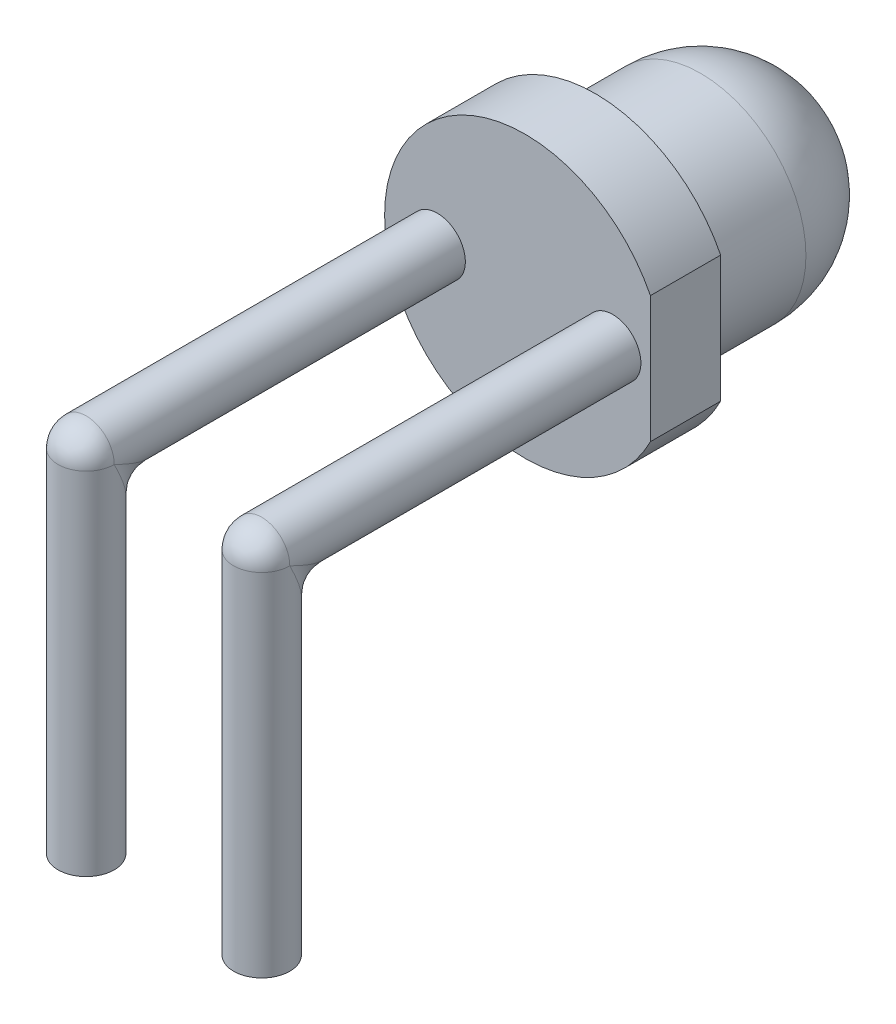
ISO-10303-21;
HEADER;
FILE_DESCRIPTION(('STEP AP214'),'2;1');
FILE_NAME('part.step','',(''),(''),'','','');
FILE_SCHEMA(('AUTOMOTIVE_DESIGN { 1 0 10303 214 1 1 1 1 }'));
ENDSEC;
DATA;
#1=APPLICATION_CONTEXT('core data for automotive mechanical design processes');
#2=APPLICATION_PROTOCOL_DEFINITION('international standard','automotive_design',2000,#1);
#3=PRODUCT_CONTEXT('',#1,'mechanical');
#4=PRODUCT('Part','Part','',(#3));
#5=PRODUCT_RELATED_PRODUCT_CATEGORY('part','',(#4));
#6=PRODUCT_DEFINITION_FORMATION('','',#4);
#7=PRODUCT_DEFINITION_CONTEXT('part definition',#1,'design');
#8=PRODUCT_DEFINITION('design','',#6,#7);
#9=PRODUCT_DEFINITION_SHAPE('','',#8);
#10=(LENGTH_UNIT() NAMED_UNIT(*) SI_UNIT(.MILLI.,.METRE.));
#11=(NAMED_UNIT(*) PLANE_ANGLE_UNIT() SI_UNIT($,.RADIAN.));
#12=(NAMED_UNIT(*) SI_UNIT($,.STERADIAN.) SOLID_ANGLE_UNIT());
#13=UNCERTAINTY_MEASURE_WITH_UNIT(LENGTH_MEASURE(1.E-05),#10,'distance_accuracy_value','');
#14=(GEOMETRIC_REPRESENTATION_CONTEXT(3) GLOBAL_UNCERTAINTY_ASSIGNED_CONTEXT((#13)) GLOBAL_UNIT_ASSIGNED_CONTEXT((#10,
#11,#12)) REPRESENTATION_CONTEXT('',''));
#15=CARTESIAN_POINT('',(0.,0.,0.));
#16=DIRECTION('',(0.,0.,1.));
#17=DIRECTION('',(1.,0.,0.));
#18=AXIS2_PLACEMENT_3D('',#15,#16,#17);
#19=CARTESIAN_POINT('',(0.,0.,4.));
#20=DIRECTION('',(0.,0.,-1.));
#21=DIRECTION('',(-1.,0.,0.));
#22=AXIS2_PLACEMENT_3D('',#19,#20,#21);
#23=CYLINDRICAL_SURFACE('',#22,1.5);
#24=CARTESIAN_POINT('',(0.,0.,1.5));
#25=DIRECTION('',(0.,0.,-1.));
#26=DIRECTION('',(-1.,0.,0.));
#27=AXIS2_PLACEMENT_3D('',#24,#25,#26);
#28=CIRCLE('',#27,1.5);
#29=CARTESIAN_POINT('',(-1.5,0.,1.5));
#30=VERTEX_POINT('',#29);
#31=EDGE_CURVE('E94',#30,#30,#28,.F.);
#32=ORIENTED_EDGE('',*,*,#31,.T.);
#33=EDGE_LOOP('',(#32));
#34=FACE_BOUND('',#33,.T.);
#35=CARTESIAN_POINT('',(0.,0.,3.));
#36=DIRECTION('',(0.,0.,1.));
#37=DIRECTION('',(1.,0.,0.));
#38=AXIS2_PLACEMENT_3D('',#35,#36,#37);
#39=CIRCLE('',#38,1.5);
#40=CARTESIAN_POINT('',(1.5,0.,3.));
#41=VERTEX_POINT('',#40);
#42=EDGE_CURVE('E90',#41,#41,#39,.T.);
#43=ORIENTED_EDGE('',*,*,#42,.F.);
#44=EDGE_LOOP('',(#43));
#45=FACE_BOUND('',#44,.T.);
#46=ADVANCED_FACE('F28',(#34,#45),#23,.T.);
#47=CARTESIAN_POINT('',(0.,0.,3.));
#48=DIRECTION('',(0.,0.,1.));
#49=DIRECTION('',(1.,0.,0.));
#50=AXIS2_PLACEMENT_3D('',#47,#48,#49);
#51=PLANE('',#50);
#52=CARTESIAN_POINT('',(0.,0.,3.));
#53=DIRECTION('',(0.,0.,1.));
#54=DIRECTION('',(1.,0.,0.));
#55=AXIS2_PLACEMENT_3D('',#52,#53,#54);
#56=CIRCLE('',#55,2.);
#57=CARTESIAN_POINT('',(1.78571428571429,0.900680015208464,3.));
#58=VERTEX_POINT('',#57);
#59=CARTESIAN_POINT('',(1.78571428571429,-0.900680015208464,3.));
#60=VERTEX_POINT('',#59);
#61=EDGE_CURVE('E71',#58,#60,#56,.T.);
#62=ORIENTED_EDGE('',*,*,#61,.F.);
#63=DIRECTION('',(0.,1.,0.));
#64=VECTOR('',#63,1.);
#65=CARTESIAN_POINT('',(1.78571428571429,0.900680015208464,3.));
#66=LINE('',#65,#64);
#67=EDGE_CURVE('E77',#60,#58,#66,.T.);
#68=ORIENTED_EDGE('',*,*,#67,.F.);
#69=EDGE_LOOP('',(#62,#68));
#70=FACE_BOUND('',#69,.T.);
#71=ORIENTED_EDGE('',*,*,#42,.T.);
#72=EDGE_LOOP('',(#71));
#73=FACE_BOUND('',#72,.T.);
#74=ADVANCED_FACE('F135',(#70,#73),#51,.F.);
#75=CARTESIAN_POINT('',(0.,0.,3.));
#76=DIRECTION('',(0.,0.,1.));
#77=DIRECTION('',(1.,0.,0.));
#78=AXIS2_PLACEMENT_3D('',#75,#76,#77);
#79=CYLINDRICAL_SURFACE('',#78,2.);
#80=CARTESIAN_POINT('',(0.,0.,4.));
#81=DIRECTION('',(0.,0.,1.));
#82=DIRECTION('',(1.,0.,0.));
#83=AXIS2_PLACEMENT_3D('',#80,#81,#82);
#84=CIRCLE('',#83,2.);
#85=CARTESIAN_POINT('',(1.78571428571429,0.900680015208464,4.));
#86=VERTEX_POINT('',#85);
#87=CARTESIAN_POINT('',(1.78571428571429,-0.900680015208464,4.));
#88=VERTEX_POINT('',#87);
#89=EDGE_CURVE('E68',#86,#88,#84,.T.);
#90=ORIENTED_EDGE('',*,*,#89,.F.);
#91=DIRECTION('',(0.,0.,1.));
#92=VECTOR('',#91,1.);
#93=CARTESIAN_POINT('',(1.78571428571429,0.900680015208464,3.));
#94=LINE('',#93,#92);
#95=EDGE_CURVE('E76',#58,#86,#94,.T.);
#96=ORIENTED_EDGE('',*,*,#95,.F.);
#97=ORIENTED_EDGE('',*,*,#61,.T.);
#98=DIRECTION('',(0.,0.,1.));
#99=VECTOR('',#98,1.);
#100=CARTESIAN_POINT('',(1.78571428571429,-0.900680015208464,3.));
#101=LINE('',#100,#99);
#102=EDGE_CURVE('E65',#60,#88,#101,.T.);
#103=ORIENTED_EDGE('',*,*,#102,.T.);
#104=EDGE_LOOP('',(#90,#96,#97,#103));
#105=FACE_BOUND('',#104,.T.);
#106=ADVANCED_FACE('F67',(#105),#79,.T.);
#107=CARTESIAN_POINT('',(1.78571428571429,0.900680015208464,3.));
#108=DIRECTION('',(1.,0.,0.));
#109=DIRECTION('',(0.,0.,-1.));
#110=AXIS2_PLACEMENT_3D('',#107,#108,#109);
#111=PLANE('',#110);
#112=DIRECTION('',(0.,1.,0.));
#113=VECTOR('',#112,1.);
#114=CARTESIAN_POINT('',(1.78571428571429,0.900680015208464,4.));
#115=LINE('',#114,#113);
#116=EDGE_CURVE('E81',#88,#86,#115,.T.);
#117=ORIENTED_EDGE('',*,*,#116,.F.);
#118=ORIENTED_EDGE('',*,*,#102,.F.);
#119=ORIENTED_EDGE('',*,*,#67,.T.);
#120=ORIENTED_EDGE('',*,*,#95,.T.);
#121=EDGE_LOOP('',(#117,#118,#119,#120));
#122=FACE_BOUND('',#121,.T.);
#123=ADVANCED_FACE('F84',(#122),#111,.T.);
#124=CARTESIAN_POINT('',(0.,0.,4.));
#125=DIRECTION('',(0.,0.,1.));
#126=DIRECTION('',(1.,0.,0.));
#127=AXIS2_PLACEMENT_3D('',#124,#125,#126);
#128=PLANE('',#127);
#129=CARTESIAN_POINT('',(1.25,0.,4.));
#130=DIRECTION('',(0.,0.,1.));
#131=DIRECTION('',(1.,0.,0.));
#132=AXIS2_PLACEMENT_3D('',#129,#130,#131);
#133=CIRCLE('',#132,0.4);
#134=CARTESIAN_POINT('',(1.65,0.,4.));
#135=VERTEX_POINT('',#134);
#136=EDGE_CURVE('E102',#135,#135,#133,.T.);
#137=ORIENTED_EDGE('',*,*,#136,.F.);
#138=EDGE_LOOP('',(#137));
#139=FACE_BOUND('',#138,.T.);
#140=CARTESIAN_POINT('',(-1.25,0.,4.));
#141=DIRECTION('',(0.,0.,1.));
#142=DIRECTION('',(1.,0.,0.));
#143=AXIS2_PLACEMENT_3D('',#140,#141,#142);
#144=CIRCLE('',#143,0.4);
#145=CARTESIAN_POINT('',(-0.85,0.,4.));
#146=VERTEX_POINT('',#145);
#147=EDGE_CURVE('E97',#146,#146,#144,.T.);
#148=ORIENTED_EDGE('',*,*,#147,.F.);
#149=EDGE_LOOP('',(#148));
#150=FACE_BOUND('',#149,.T.);
#151=ORIENTED_EDGE('',*,*,#89,.T.);
#152=ORIENTED_EDGE('',*,*,#116,.T.);
#153=EDGE_LOOP('',(#151,#152));
#154=FACE_BOUND('',#153,.T.);
#155=ADVANCED_FACE('F80',(#139,#150,#154),#128,.T.);
#156=CARTESIAN_POINT('',(0.,0.,1.5));
#157=DIRECTION('',(0.,0.,1.));
#158=DIRECTION('',(1.,0.,0.));
#159=AXIS2_PLACEMENT_3D('',#156,#157,#158);
#160=SPHERICAL_SURFACE('',#159,1.5);
#161=ORIENTED_EDGE('',*,*,#31,.F.);
#162=EDGE_LOOP('',(#161));
#163=FACE_BOUND('',#162,.T.);
#164=ADVANCED_FACE('F149',(#163),#160,.T.);
#165=CARTESIAN_POINT('',(-1.25,0.,9.));
#166=DIRECTION('',(0.,-1.,0.));
#167=DIRECTION('',(0.,0.,-1.));
#168=AXIS2_PLACEMENT_3D('',#165,#166,#167);
#169=CYLINDRICAL_SURFACE('',#168,0.4);
#170=CARTESIAN_POINT('',(-1.25,0.,9.));
#171=DIRECTION('',(0.,0.447213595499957,-0.894427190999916));
#172=DIRECTION('',(0.,-0.894427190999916,-0.447213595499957));
#173=AXIS2_PLACEMENT_3D('',#170,#171,#172);
#174=ELLIPSE('',#173,0.894427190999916,0.4);
#175=CARTESIAN_POINT('',(-1.65,0.,9.));
#176=VERTEX_POINT('',#175);
#177=CARTESIAN_POINT('',(-0.85,0.,9.));
#178=VERTEX_POINT('',#177);
#179=EDGE_CURVE('E111',#176,#178,#174,.F.);
#180=ORIENTED_EDGE('',*,*,#179,.T.);
#181=CARTESIAN_POINT('',(-1.25,0.,9.));
#182=DIRECTION('',(0.,-1.,0.));
#183=DIRECTION('',(0.,0.,-1.));
#184=AXIS2_PLACEMENT_3D('',#181,#182,#183);
#185=CIRCLE('',#184,0.4);
#186=EDGE_CURVE('E114',#178,#176,#185,.T.);
#187=ORIENTED_EDGE('',*,*,#186,.T.);
#188=EDGE_LOOP('',(#180,#187));
#189=FACE_BOUND('',#188,.T.);
#190=CARTESIAN_POINT('',(-1.25,-5.,9.));
#191=DIRECTION('',(0.,-1.,0.));
#192=DIRECTION('',(0.,0.,-1.));
#193=AXIS2_PLACEMENT_3D('',#190,#191,#192);
#194=CIRCLE('',#193,0.4);
#195=CARTESIAN_POINT('',(-1.25,-5.,8.6));
#196=VERTEX_POINT('',#195);
#197=EDGE_CURVE('E82',#196,#196,#194,.F.);
#198=ORIENTED_EDGE('',*,*,#197,.T.);
#199=EDGE_LOOP('',(#198));
#200=FACE_BOUND('',#199,.T.);
#201=ADVANCED_FACE('F119',(#189,#200),#169,.T.);
#202=CARTESIAN_POINT('',(-1.25,0.,10.1313708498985));
#203=DIRECTION('',(0.,0.,-1.));
#204=DIRECTION('',(0.,1.,0.));
#205=AXIS2_PLACEMENT_3D('',#202,#203,#204);
#206=CYLINDRICAL_SURFACE('',#205,0.4);
#207=ORIENTED_EDGE('',*,*,#147,.T.);
#208=EDGE_LOOP('',(#207));
#209=FACE_BOUND('',#208,.T.);
#210=CARTESIAN_POINT('',(-1.25,0.,9.));
#211=DIRECTION('',(0.,0.,-1.));
#212=DIRECTION('',(0.,1.,0.));
#213=AXIS2_PLACEMENT_3D('',#210,#211,#212);
#214=CIRCLE('',#213,0.4);
#215=EDGE_CURVE('E35',#176,#178,#214,.T.);
#216=ORIENTED_EDGE('',*,*,#215,.T.);
#217=CARTESIAN_POINT('',(-1.25,0.,9.));
#218=DIRECTION('',(0.,0.894427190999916,-0.447213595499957));
#219=DIRECTION('',(0.,-0.447213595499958,-0.894427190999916));
#220=AXIS2_PLACEMENT_3D('',#217,#218,#219);
#221=ELLIPSE('',#220,0.894427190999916,0.4);
#222=EDGE_CURVE('E12',#178,#176,#221,.T.);
#223=ORIENTED_EDGE('',*,*,#222,.T.);
#224=EDGE_LOOP('',(#216,#223));
#225=FACE_BOUND('',#224,.T.);
#226=ADVANCED_FACE('F117',(#209,#225),#206,.T.);
#227=CARTESIAN_POINT('',(-1.25,-5.,9.));
#228=DIRECTION('',(0.,-1.,0.));
#229=DIRECTION('',(0.,0.,-1.));
#230=AXIS2_PLACEMENT_3D('',#227,#228,#229);
#231=PLANE('',#230);
#232=ORIENTED_EDGE('',*,*,#197,.F.);
#233=EDGE_LOOP('',(#232));
#234=FACE_BOUND('',#233,.T.);
#235=ADVANCED_FACE('F192',(#234),#231,.T.);
#236=CARTESIAN_POINT('',(1.25,0.,9.));
#237=DIRECTION('',(0.,-1.,0.));
#238=DIRECTION('',(0.,0.,-1.));
#239=AXIS2_PLACEMENT_3D('',#236,#237,#238);
#240=CYLINDRICAL_SURFACE('',#239,0.4);
#241=CARTESIAN_POINT('',(1.25,0.,9.));
#242=DIRECTION('',(0.,0.447213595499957,-0.894427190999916));
#243=DIRECTION('',(0.,-0.894427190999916,-0.447213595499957));
#244=AXIS2_PLACEMENT_3D('',#241,#242,#243);
#245=ELLIPSE('',#244,0.894427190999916,0.4);
#246=CARTESIAN_POINT('',(0.85,0.,9.));
#247=VERTEX_POINT('',#246);
#248=CARTESIAN_POINT('',(1.65,0.,9.));
#249=VERTEX_POINT('',#248);
#250=EDGE_CURVE('E98',#247,#249,#245,.F.);
#251=ORIENTED_EDGE('',*,*,#250,.T.);
#252=CARTESIAN_POINT('',(1.25,0.,9.));
#253=DIRECTION('',(0.,-1.,0.));
#254=DIRECTION('',(0.,0.,-1.));
#255=AXIS2_PLACEMENT_3D('',#252,#253,#254);
#256=CIRCLE('',#255,0.4);
#257=EDGE_CURVE('E101',#249,#247,#256,.T.);
#258=ORIENTED_EDGE('',*,*,#257,.T.);
#259=EDGE_LOOP('',(#251,#258));
#260=FACE_BOUND('',#259,.T.);
#261=CARTESIAN_POINT('',(1.25,-5.,9.));
#262=DIRECTION('',(0.,-1.,0.));
#263=DIRECTION('',(0.,0.,-1.));
#264=AXIS2_PLACEMENT_3D('',#261,#262,#263);
#265=CIRCLE('',#264,0.4);
#266=CARTESIAN_POINT('',(1.25,-5.,8.6));
#267=VERTEX_POINT('',#266);
#268=EDGE_CURVE('E255',#267,#267,#265,.F.);
#269=ORIENTED_EDGE('',*,*,#268,.T.);
#270=EDGE_LOOP('',(#269));
#271=FACE_BOUND('',#270,.T.);
#272=ADVANCED_FACE('F199',(#260,#271),#240,.T.);
#273=CARTESIAN_POINT('',(1.25,0.,10.1313708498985));
#274=DIRECTION('',(0.,0.,-1.));
#275=DIRECTION('',(0.,1.,0.));
#276=AXIS2_PLACEMENT_3D('',#273,#274,#275);
#277=CYLINDRICAL_SURFACE('',#276,0.4);
#278=ORIENTED_EDGE('',*,*,#136,.T.);
#279=EDGE_LOOP('',(#278));
#280=FACE_BOUND('',#279,.T.);
#281=CARTESIAN_POINT('',(1.25,0.,9.));
#282=DIRECTION('',(0.,0.,-1.));
#283=DIRECTION('',(0.,1.,0.));
#284=AXIS2_PLACEMENT_3D('',#281,#282,#283);
#285=CIRCLE('',#284,0.4);
#286=EDGE_CURVE('E105',#247,#249,#285,.T.);
#287=ORIENTED_EDGE('',*,*,#286,.T.);
#288=CARTESIAN_POINT('',(1.25,0.,9.));
#289=DIRECTION('',(0.,0.894427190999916,-0.447213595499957));
#290=DIRECTION('',(0.,-0.447213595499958,-0.894427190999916));
#291=AXIS2_PLACEMENT_3D('',#288,#289,#290);
#292=ELLIPSE('',#291,0.894427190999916,0.4);
#293=EDGE_CURVE('E108',#249,#247,#292,.T.);
#294=ORIENTED_EDGE('',*,*,#293,.T.);
#295=EDGE_LOOP('',(#287,#294));
#296=FACE_BOUND('',#295,.T.);
#297=ADVANCED_FACE('F206',(#280,#296),#277,.T.);
#298=CARTESIAN_POINT('',(1.25,-5.,9.));
#299=DIRECTION('',(0.,-1.,0.));
#300=DIRECTION('',(0.,0.,-1.));
#301=AXIS2_PLACEMENT_3D('',#298,#299,#300);
#302=PLANE('',#301);
#303=ORIENTED_EDGE('',*,*,#268,.F.);
#304=EDGE_LOOP('',(#303));
#305=FACE_BOUND('',#304,.T.);
#306=ADVANCED_FACE('F214',(#305),#302,.T.);
#307=CARTESIAN_POINT('',(1.25,0.,9.));
#308=DIRECTION('',(0.,0.,1.));
#309=DIRECTION('',(1.,0.,0.));
#310=AXIS2_PLACEMENT_3D('',#307,#308,#309);
#311=SPHERICAL_SURFACE('',#310,0.4);
#312=ORIENTED_EDGE('',*,*,#257,.F.);
#313=ORIENTED_EDGE('',*,*,#286,.F.);
#314=EDGE_LOOP('',(#312,#313));
#315=FACE_BOUND('',#314,.T.);
#316=ADVANCED_FACE('F131',(#315),#311,.T.);
#317=CARTESIAN_POINT('',(0.85,0.,9.));
#318=CARTESIAN_POINT('',(0.850000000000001,0.,9.));
#319=CARTESIAN_POINT('',(0.85,0.,9.));
#320=CARTESIAN_POINT('',(0.850007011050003,-0.034851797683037,8.98257410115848));
#321=CARTESIAN_POINT('',(0.849948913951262,-0.026144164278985,8.97385583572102));
#322=CARTESIAN_POINT('',(0.850007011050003,-0.0174258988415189,8.96514820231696));
#323=CARTESIAN_POINT('',(0.851139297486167,-0.0697124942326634,8.96514375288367));
#324=CARTESIAN_POINT('',(0.852279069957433,-0.0523600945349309,8.94763990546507));
#325=CARTESIAN_POINT('',(0.851139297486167,-0.0348562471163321,8.93028750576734));
#326=CARTESIAN_POINT('',(0.85568541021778,-0.138834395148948,8.93058280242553));
#327=CARTESIAN_POINT('',(0.861366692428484,-0.103749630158,8.896250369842));
#328=CARTESIAN_POINT('',(0.85568541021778,-0.0694171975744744,8.86116560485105));
#329=CARTESIAN_POINT('',(0.859079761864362,-0.173098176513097,8.91345091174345));
#330=CARTESIAN_POINT('',(0.868137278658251,-0.129071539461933,8.87092846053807));
#331=CARTESIAN_POINT('',(0.859079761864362,-0.0865490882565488,8.8269018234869));
#332=CARTESIAN_POINT('',(0.868103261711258,-0.240442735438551,8.87977863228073));
#333=CARTESIAN_POINT('',(0.885850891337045,-0.177786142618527,8.82221385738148));
#334=CARTESIAN_POINT('',(0.868103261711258,-0.120221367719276,8.75955726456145));
#335=CARTESIAN_POINT('',(0.873693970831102,-0.273533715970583,8.86323314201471));
#336=CARTESIAN_POINT('',(0.896819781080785,-0.201325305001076,8.79867469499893));
#337=CARTESIAN_POINT('',(0.873693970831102,-0.136766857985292,8.72646628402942));
#338=CARTESIAN_POINT('',(0.887036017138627,-0.337956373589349,8.83102181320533));
#339=CARTESIAN_POINT('',(0.922365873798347,-0.24561650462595,8.75438349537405));
#340=CARTESIAN_POINT('',(0.887036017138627,-0.168978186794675,8.66204362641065));
#341=CARTESIAN_POINT('',(0.894730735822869,-0.369311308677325,8.81534434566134));
#342=CARTESIAN_POINT('',(0.936981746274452,-0.266510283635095,8.73348971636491));
#343=CARTESIAN_POINT('',(0.89473073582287,-0.184655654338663,8.63068869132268));
#344=CARTESIAN_POINT('',(0.912166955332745,-0.429711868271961,8.78514406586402));
#345=CARTESIAN_POINT('',(0.968999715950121,-0.304712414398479,8.69528758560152));
#346=CARTESIAN_POINT('',(0.912166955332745,-0.214855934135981,8.57028813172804));
#347=CARTESIAN_POINT('',(0.921835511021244,-0.458799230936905,8.77060038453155));
#348=CARTESIAN_POINT('',(0.986451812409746,-0.322154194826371,8.67784580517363));
#349=CARTESIAN_POINT('',(0.921835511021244,-0.229399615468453,8.5412007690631));
#350=CARTESIAN_POINT('',(0.943070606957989,-0.514147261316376,8.74292636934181));
#351=CARTESIAN_POINT('',(1.02298136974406,-0.352779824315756,8.64722017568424));
#352=CARTESIAN_POINT('',(0.943070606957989,-0.257073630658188,8.48585273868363));
#353=CARTESIAN_POINT('',(0.954551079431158,-0.540473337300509,8.72976333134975));
#354=CARTESIAN_POINT('',(1.04211684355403,-0.366083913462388,8.63391608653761));
#355=CARTESIAN_POINT('',(0.954551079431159,-0.270236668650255,8.45952666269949));
#356=CARTESIAN_POINT('',(0.979226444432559,-0.589823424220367,8.70508828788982));
#357=CARTESIAN_POINT('',(1.08048212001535,-0.388004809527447,8.61199519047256));
#358=CARTESIAN_POINT('',(0.979226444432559,-0.294911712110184,8.41017657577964));
#359=CARTESIAN_POINT('',(0.992327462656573,-0.612940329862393,8.6935298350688));
#360=CARTESIAN_POINT('',(1.09977183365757,-0.396723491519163,8.60327650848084));
#361=CARTESIAN_POINT('',(0.992327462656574,-0.306470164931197,8.38705967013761));
#362=CARTESIAN_POINT('',(1.02002657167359,-0.655447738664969,8.67227613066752));
#363=CARTESIAN_POINT('',(1.13658531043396,-0.409472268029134,8.59052773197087));
#364=CARTESIAN_POINT('',(1.02002657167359,-0.327723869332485,8.34455226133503));
#365=CARTESIAN_POINT('',(1.03453090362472,-0.67495903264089,8.66252048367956));
#366=CARTESIAN_POINT('',(1.15416238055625,-0.413582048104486,8.58641795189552));
#367=CARTESIAN_POINT('',(1.03453090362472,-0.337479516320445,8.32504096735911));
#368=CARTESIAN_POINT('',(1.06478591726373,-0.709892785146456,8.64505360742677));
#369=CARTESIAN_POINT('',(1.18560301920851,-0.417771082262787,8.58222891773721));
#370=CARTESIAN_POINT('',(1.06478591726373,-0.354946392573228,8.29010721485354));
#371=CARTESIAN_POINT('',(1.08045326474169,-0.725457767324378,8.63727111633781));
#372=CARTESIAN_POINT('',(1.19950490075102,-0.417907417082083,8.58209258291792));
#373=CARTESIAN_POINT('',(1.08045326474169,-0.362728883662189,8.27454223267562));
#374=CARTESIAN_POINT('',(1.11275138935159,-0.752212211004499,8.62389389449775));
#375=CARTESIAN_POINT('',(1.2221313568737,-0.415624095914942,8.58437590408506));
#376=CARTESIAN_POINT('',(1.11275138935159,-0.37610610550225,8.2477877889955));
#377=CARTESIAN_POINT('',(1.12931994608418,-0.763549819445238,8.61822509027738));
#378=CARTESIAN_POINT('',(1.23087565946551,-0.413242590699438,8.58675740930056));
#379=CARTESIAN_POINT('',(1.12931994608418,-0.381774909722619,8.23645018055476));
#380=CARTESIAN_POINT('',(1.16310979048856,-0.781655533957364,8.60917223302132));
#381=CARTESIAN_POINT('',(1.2430647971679,-0.408038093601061,8.59196190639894));
#382=CARTESIAN_POINT('',(1.16310979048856,-0.390827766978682,8.21834446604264));
#383=CARTESIAN_POINT('',(1.18029654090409,-0.78855062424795,8.60572468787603));
#384=CARTESIAN_POINT('',(1.24651525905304,-0.405239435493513,8.59476056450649));
#385=CARTESIAN_POINT('',(1.18029654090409,-0.394275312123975,8.21144937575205));
#386=CARTESIAN_POINT('',(1.21499550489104,-0.79768559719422,8.60115720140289));
#387=CARTESIAN_POINT('',(1.24997691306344,-0.401214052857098,8.5987859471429));
#388=CARTESIAN_POINT('',(1.21499550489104,-0.39884279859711,8.20231440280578));
#389=CARTESIAN_POINT('',(1.23249775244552,-0.800000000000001,8.6));
#390=CARTESIAN_POINT('',(1.24998842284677,-0.400000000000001,8.6));
#391=CARTESIAN_POINT('',(1.23249775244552,-0.400000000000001,8.2));
#392=CARTESIAN_POINT('',(1.26750224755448,-0.800000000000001,8.6));
#393=CARTESIAN_POINT('',(1.25001157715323,-0.400000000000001,8.6));
#394=CARTESIAN_POINT('',(1.26750224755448,-0.400000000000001,8.2));
#395=CARTESIAN_POINT('',(1.28500449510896,-0.79768559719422,8.60115720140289));
#396=CARTESIAN_POINT('',(1.25002308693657,-0.401214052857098,8.5987859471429));
#397=CARTESIAN_POINT('',(1.28500449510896,-0.39884279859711,8.20231440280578));
#398=CARTESIAN_POINT('',(1.31970345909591,-0.78855062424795,8.60572468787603));
#399=CARTESIAN_POINT('',(1.25348474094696,-0.405239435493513,8.59476056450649));
#400=CARTESIAN_POINT('',(1.31970345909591,-0.394275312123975,8.21144937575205));
#401=CARTESIAN_POINT('',(1.33689020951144,-0.781655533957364,8.60917223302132));
#402=CARTESIAN_POINT('',(1.2569352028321,-0.408038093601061,8.59196190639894));
#403=CARTESIAN_POINT('',(1.33689020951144,-0.390827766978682,8.21834446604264));
#404=CARTESIAN_POINT('',(1.37068005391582,-0.763549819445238,8.61822509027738));
#405=CARTESIAN_POINT('',(1.26912434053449,-0.413242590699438,8.58675740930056));
#406=CARTESIAN_POINT('',(1.37068005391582,-0.381774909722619,8.23645018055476));
#407=CARTESIAN_POINT('',(1.38724861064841,-0.752212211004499,8.62389389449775));
#408=CARTESIAN_POINT('',(1.2778686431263,-0.415624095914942,8.58437590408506));
#409=CARTESIAN_POINT('',(1.38724861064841,-0.37610610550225,8.2477877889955));
#410=CARTESIAN_POINT('',(1.41954673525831,-0.725457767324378,8.63727111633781));
#411=CARTESIAN_POINT('',(1.30049509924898,-0.417907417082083,8.58209258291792));
#412=CARTESIAN_POINT('',(1.41954673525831,-0.362728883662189,8.27454223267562));
#413=CARTESIAN_POINT('',(1.43521408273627,-0.709892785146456,8.64505360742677));
#414=CARTESIAN_POINT('',(1.31439698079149,-0.417771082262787,8.58222891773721));
#415=CARTESIAN_POINT('',(1.43521408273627,-0.354946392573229,8.29010721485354));
#416=CARTESIAN_POINT('',(1.46546909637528,-0.674959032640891,8.66252048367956));
#417=CARTESIAN_POINT('',(1.34583761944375,-0.413582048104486,8.58641795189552));
#418=CARTESIAN_POINT('',(1.46546909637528,-0.337479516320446,8.32504096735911));
#419=CARTESIAN_POINT('',(1.47997342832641,-0.655447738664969,8.67227613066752));
#420=CARTESIAN_POINT('',(1.36341468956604,-0.409472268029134,8.59052773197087));
#421=CARTESIAN_POINT('',(1.47997342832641,-0.327723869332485,8.34455226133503));
#422=CARTESIAN_POINT('',(1.50767253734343,-0.612940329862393,8.69352983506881));
#423=CARTESIAN_POINT('',(1.40022816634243,-0.396723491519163,8.60327650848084));
#424=CARTESIAN_POINT('',(1.50767253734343,-0.306470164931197,8.38705967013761));
#425=CARTESIAN_POINT('',(1.52077355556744,-0.589823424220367,8.70508828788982));
#426=CARTESIAN_POINT('',(1.41951787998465,-0.388004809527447,8.61199519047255));
#427=CARTESIAN_POINT('',(1.52077355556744,-0.294911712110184,8.41017657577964));
#428=CARTESIAN_POINT('',(1.54544892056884,-0.540473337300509,8.72976333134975));
#429=CARTESIAN_POINT('',(1.45788315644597,-0.366083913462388,8.63391608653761));
#430=CARTESIAN_POINT('',(1.54544892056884,-0.270236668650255,8.45952666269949));
#431=CARTESIAN_POINT('',(1.55692939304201,-0.514147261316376,8.74292636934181));
#432=CARTESIAN_POINT('',(1.47701863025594,-0.352779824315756,8.64722017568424));
#433=CARTESIAN_POINT('',(1.55692939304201,-0.257073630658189,8.48585273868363));
#434=CARTESIAN_POINT('',(1.57816448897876,-0.458799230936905,8.77060038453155));
#435=CARTESIAN_POINT('',(1.51354818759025,-0.322154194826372,8.67784580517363));
#436=CARTESIAN_POINT('',(1.57816448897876,-0.229399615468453,8.5412007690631));
#437=CARTESIAN_POINT('',(1.58783304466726,-0.429711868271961,8.78514406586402));
#438=CARTESIAN_POINT('',(1.53100028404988,-0.304712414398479,8.69528758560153));
#439=CARTESIAN_POINT('',(1.58783304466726,-0.214855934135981,8.57028813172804));
#440=CARTESIAN_POINT('',(1.60526926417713,-0.369311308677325,8.81534434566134));
#441=CARTESIAN_POINT('',(1.56301825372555,-0.266510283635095,8.73348971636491));
#442=CARTESIAN_POINT('',(1.60526926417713,-0.184655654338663,8.63068869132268));
#443=CARTESIAN_POINT('',(1.61296398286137,-0.337956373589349,8.83102181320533));
#444=CARTESIAN_POINT('',(1.57763412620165,-0.24561650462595,8.75438349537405));
#445=CARTESIAN_POINT('',(1.61296398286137,-0.168978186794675,8.66204362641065));
#446=CARTESIAN_POINT('',(1.6263060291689,-0.273533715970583,8.86323314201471));
#447=CARTESIAN_POINT('',(1.60318021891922,-0.201325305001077,8.79867469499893));
#448=CARTESIAN_POINT('',(1.6263060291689,-0.136766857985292,8.72646628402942));
#449=CARTESIAN_POINT('',(1.63189673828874,-0.240442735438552,8.87977863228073));
#450=CARTESIAN_POINT('',(1.61414910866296,-0.177786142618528,8.82221385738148));
#451=CARTESIAN_POINT('',(1.63189673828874,-0.120221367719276,8.75955726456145));
#452=CARTESIAN_POINT('',(1.64092023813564,-0.173098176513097,8.91345091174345));
#453=CARTESIAN_POINT('',(1.63186272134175,-0.129071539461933,8.87092846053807));
#454=CARTESIAN_POINT('',(1.64092023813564,-0.0865490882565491,8.8269018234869));
#455=CARTESIAN_POINT('',(1.64431458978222,-0.138834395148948,8.93058280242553));
#456=CARTESIAN_POINT('',(1.63863330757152,-0.103749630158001,8.896250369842));
#457=CARTESIAN_POINT('',(1.64431458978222,-0.0694171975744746,8.86116560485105));
#458=CARTESIAN_POINT('',(1.64886070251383,-0.0697124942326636,8.96514375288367));
#459=CARTESIAN_POINT('',(1.64772093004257,-0.0523600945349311,8.94763990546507));
#460=CARTESIAN_POINT('',(1.64886070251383,-0.0348562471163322,8.93028750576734));
#461=CARTESIAN_POINT('',(1.64999298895,-0.034851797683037,8.98257410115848));
#462=CARTESIAN_POINT('',(1.65005108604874,-0.0261441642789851,8.97385583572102));
#463=CARTESIAN_POINT('',(1.64999298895,-0.017425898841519,8.96514820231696));
#464=CARTESIAN_POINT('',(1.65,0.,9.));
#465=CARTESIAN_POINT('',(1.65,0.,9.));
#466=CARTESIAN_POINT('',(1.65,0.,9.));
#467=(BOUNDED_SURFACE() B_SPLINE_SURFACE(3,2,((#317,#318,#319),(#320,#321,#322),(#323,#324,
#325),(#326,#327,#328),(#329,#330,#331),(#332,#333,#334),(#335,#336,#337),(#338,#339,#340),
(#341,#342,#343),(#344,#345,#346),(#347,#348,#349),(#350,#351,#352),(#353,#354,#355),(#356,#357,
#358),(#359,#360,#361),(#362,#363,#364),(#365,#366,#367),(#368,#369,#370),(#371,#372,#373),
(#374,#375,#376),(#377,#378,#379),(#380,#381,#382),(#383,#384,#385),(#386,#387,#388),(#389,#390,
#391),(#392,#393,#394),(#395,#396,#397),(#398,#399,#400),(#401,#402,#403),(#404,#405,#406),
(#407,#408,#409),(#410,#411,#412),(#413,#414,#415),(#416,#417,#418),(#419,#420,#421),(#422,#423,
#424),(#425,#426,#427),(#428,#429,#430),(#431,#432,#433),(#434,#435,#436),(#437,#438,#439),
(#440,#441,#442),(#443,#444,#445),(#446,#447,#448),(#449,#450,#451),(#452,#453,#454),(#455,#456,
#457),(#458,#459,#460),(#461,#462,#463),(#464,#465,#466)),.UNSPECIFIED.,.F.,.F.,
.F.) B_SPLINE_SURFACE_WITH_KNOTS((4,2,2,2,2,2,2,2,2,2,2,2,2,2,2,2,2,2,2,2,2,2,2,2,4),(3,3),(0.,
0.147832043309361,0.294407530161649,0.438524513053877,0.579091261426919,0.715183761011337,
0.84610562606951,0.971449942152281,1.09116027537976,1.2055837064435,1.31550198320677,
1.42211980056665,1.52698838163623,1.63185696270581,1.73847478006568,1.84839305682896,
1.9628164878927,2.08252682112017,2.20787113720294,2.33879300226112,2.47488550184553,
2.61545225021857,2.7595692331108,2.90614471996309,3.05397676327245),(0.,1.),
.UNSPECIFIED.) GEOMETRIC_REPRESENTATION_ITEM() RATIONAL_B_SPLINE_SURFACE(((1.,1.,1.),(1.,
1.00000566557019,1.),(1.,0.998576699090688,1.),(1.,0.992910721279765,1.),(1.,0.988697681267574,
1.),(1.,0.97761712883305,1.),(1.,0.970795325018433,1.),(1.,0.954789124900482,1.),(1.,
0.945667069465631,1.),(1.,0.92548796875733,1.),(1.,0.914501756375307,1.),(1.,0.891169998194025,
1.),(1.,0.878891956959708,1.),(1.,0.853706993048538,1.),(1.,0.840849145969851,1.),(1.,
0.815387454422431,1.),(1.,0.802798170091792,1.),(1.,0.778880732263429,1.),(1.,0.767521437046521,
1.),(1.,0.747118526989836,1.),(1.,0.738001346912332,1.),(1.,0.723039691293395,1.),(1.,
0.717105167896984,1.),(1.,0.709170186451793,1.),(1.,0.707106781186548,1.),(1.,0.707106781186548,
1.),(1.,0.709170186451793,1.),(1.,0.717105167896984,1.),(1.,0.723039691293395,1.),(1.,
0.738001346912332,1.),(1.,0.747118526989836,1.),(1.,0.767521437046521,1.),(1.,0.778880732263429,
1.),(1.,0.802798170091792,1.),(1.,0.815387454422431,1.),(1.,0.84084914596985,1.),(1.,
0.853706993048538,1.),(1.,0.878891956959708,1.),(1.,0.891169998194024,1.),(1.,0.914501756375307,
1.),(1.,0.92548796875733,1.),(1.,0.945667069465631,1.),(1.,0.954789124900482,1.),(1.,
0.970795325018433,1.),(1.,0.977617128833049,1.),(1.,0.988697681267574,1.),(1.,0.992910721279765,
1.),(1.,0.998576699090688,1.),(1.,1.00000566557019,1.),(1.,1.,1.))) REPRESENTATION_ITEM('') SURFACE());
#468=ORIENTED_EDGE('',*,*,#250,.F.);
#469=ORIENTED_EDGE('',*,*,#293,.F.);
#470=EDGE_LOOP('',(#468,#469));
#471=FACE_BOUND('',#470,.T.);
#472=ADVANCED_FACE('F124',(#471),#467,.F.);
#473=CARTESIAN_POINT('',(-1.25,0.,9.));
#474=DIRECTION('',(0.,0.,1.));
#475=DIRECTION('',(1.,0.,0.));
#476=AXIS2_PLACEMENT_3D('',#473,#474,#475);
#477=SPHERICAL_SURFACE('',#476,0.4);
#478=ORIENTED_EDGE('',*,*,#186,.F.);
#479=ORIENTED_EDGE('',*,*,#215,.F.);
#480=EDGE_LOOP('',(#478,#479));
#481=FACE_BOUND('',#480,.T.);
#482=ADVANCED_FACE('F121',(#481),#477,.T.);
#483=CARTESIAN_POINT('',(-1.65,0.,9.));
#484=CARTESIAN_POINT('',(-1.65,0.,9.));
#485=CARTESIAN_POINT('',(-1.65,0.,9.));
#486=CARTESIAN_POINT('',(-1.64999298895,-0.0348517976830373,8.98257410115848));
#487=CARTESIAN_POINT('',(-1.65005108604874,-0.0261441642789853,8.97385583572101));
#488=CARTESIAN_POINT('',(-1.64999298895,-0.0174258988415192,8.96514820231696));
#489=CARTESIAN_POINT('',(-1.64886070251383,-0.0697124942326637,8.96514375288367));
#490=CARTESIAN_POINT('',(-1.64772093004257,-0.0523600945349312,8.94763990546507));
#491=CARTESIAN_POINT('',(-1.64886070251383,-0.0348562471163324,8.93028750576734));
#492=CARTESIAN_POINT('',(-1.64431458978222,-0.138834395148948,8.93058280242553));
#493=CARTESIAN_POINT('',(-1.63863330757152,-0.103749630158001,8.896250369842));
#494=CARTESIAN_POINT('',(-1.64431458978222,-0.0694171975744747,8.86116560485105));
#495=CARTESIAN_POINT('',(-1.64092023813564,-0.173098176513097,8.91345091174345));
#496=CARTESIAN_POINT('',(-1.63186272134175,-0.129071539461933,8.87092846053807));
#497=CARTESIAN_POINT('',(-1.64092023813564,-0.0865490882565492,8.8269018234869));
#498=CARTESIAN_POINT('',(-1.63189673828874,-0.240442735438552,8.87977863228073));
#499=CARTESIAN_POINT('',(-1.61414910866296,-0.177786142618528,8.82221385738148));
#500=CARTESIAN_POINT('',(-1.63189673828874,-0.120221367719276,8.75955726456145));
#501=CARTESIAN_POINT('',(-1.6263060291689,-0.273533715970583,8.86323314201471));
#502=CARTESIAN_POINT('',(-1.60318021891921,-0.201325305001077,8.79867469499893));
#503=CARTESIAN_POINT('',(-1.6263060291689,-0.136766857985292,8.72646628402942));
#504=CARTESIAN_POINT('',(-1.61296398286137,-0.337956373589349,8.83102181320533));
#505=CARTESIAN_POINT('',(-1.57763412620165,-0.24561650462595,8.75438349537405));
#506=CARTESIAN_POINT('',(-1.61296398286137,-0.168978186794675,8.66204362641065));
#507=CARTESIAN_POINT('',(-1.60526926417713,-0.369311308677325,8.81534434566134));
#508=CARTESIAN_POINT('',(-1.56301825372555,-0.266510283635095,8.73348971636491));
#509=CARTESIAN_POINT('',(-1.60526926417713,-0.184655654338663,8.63068869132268));
#510=CARTESIAN_POINT('',(-1.58783304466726,-0.429711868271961,8.78514406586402));
#511=CARTESIAN_POINT('',(-1.53100028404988,-0.304712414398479,8.69528758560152));
#512=CARTESIAN_POINT('',(-1.58783304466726,-0.214855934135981,8.57028813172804));
#513=CARTESIAN_POINT('',(-1.57816448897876,-0.458799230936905,8.77060038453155));
#514=CARTESIAN_POINT('',(-1.51354818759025,-0.322154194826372,8.67784580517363));
#515=CARTESIAN_POINT('',(-1.57816448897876,-0.229399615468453,8.5412007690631));
#516=CARTESIAN_POINT('',(-1.55692939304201,-0.514147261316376,8.74292636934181));
#517=CARTESIAN_POINT('',(-1.47701863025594,-0.352779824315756,8.64722017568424));
#518=CARTESIAN_POINT('',(-1.55692939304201,-0.257073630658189,8.48585273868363));
#519=CARTESIAN_POINT('',(-1.54544892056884,-0.540473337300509,8.72976333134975));
#520=CARTESIAN_POINT('',(-1.45788315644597,-0.366083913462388,8.63391608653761));
#521=CARTESIAN_POINT('',(-1.54544892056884,-0.270236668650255,8.45952666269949));
#522=CARTESIAN_POINT('',(-1.52077355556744,-0.589823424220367,8.70508828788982));
#523=CARTESIAN_POINT('',(-1.41951787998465,-0.388004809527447,8.61199519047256));
#524=CARTESIAN_POINT('',(-1.52077355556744,-0.294911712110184,8.41017657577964));
#525=CARTESIAN_POINT('',(-1.50767253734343,-0.612940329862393,8.6935298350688));
#526=CARTESIAN_POINT('',(-1.40022816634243,-0.396723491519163,8.60327650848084));
#527=CARTESIAN_POINT('',(-1.50767253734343,-0.306470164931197,8.38705967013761));
#528=CARTESIAN_POINT('',(-1.47997342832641,-0.655447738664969,8.67227613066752));
#529=CARTESIAN_POINT('',(-1.36341468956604,-0.409472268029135,8.59052773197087));
#530=CARTESIAN_POINT('',(-1.47997342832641,-0.327723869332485,8.34455226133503));
#531=CARTESIAN_POINT('',(-1.46546909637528,-0.67495903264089,8.66252048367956));
#532=CARTESIAN_POINT('',(-1.34583761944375,-0.413582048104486,8.58641795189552));
#533=CARTESIAN_POINT('',(-1.46546909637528,-0.337479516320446,8.32504096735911));
#534=CARTESIAN_POINT('',(-1.43521408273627,-0.709892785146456,8.64505360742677));
#535=CARTESIAN_POINT('',(-1.31439698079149,-0.417771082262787,8.58222891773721));
#536=CARTESIAN_POINT('',(-1.43521408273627,-0.354946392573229,8.29010721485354));
#537=CARTESIAN_POINT('',(-1.41954673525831,-0.725457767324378,8.63727111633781));
#538=CARTESIAN_POINT('',(-1.30049509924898,-0.417907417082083,8.58209258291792));
#539=CARTESIAN_POINT('',(-1.41954673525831,-0.36272888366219,8.27454223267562));
#540=CARTESIAN_POINT('',(-1.38724861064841,-0.7522122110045,8.62389389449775));
#541=CARTESIAN_POINT('',(-1.2778686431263,-0.415624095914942,8.58437590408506));
#542=CARTESIAN_POINT('',(-1.38724861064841,-0.37610610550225,8.2477877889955));
#543=CARTESIAN_POINT('',(-1.37068005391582,-0.763549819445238,8.61822509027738));
#544=CARTESIAN_POINT('',(-1.26912434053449,-0.413242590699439,8.58675740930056));
#545=CARTESIAN_POINT('',(-1.37068005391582,-0.38177490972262,8.23645018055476));
#546=CARTESIAN_POINT('',(-1.33689020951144,-0.781655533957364,8.60917223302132));
#547=CARTESIAN_POINT('',(-1.2569352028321,-0.408038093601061,8.59196190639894));
#548=CARTESIAN_POINT('',(-1.33689020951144,-0.390827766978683,8.21834446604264));
#549=CARTESIAN_POINT('',(-1.31970345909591,-0.78855062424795,8.60572468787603));
#550=CARTESIAN_POINT('',(-1.25348474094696,-0.405239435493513,8.59476056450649));
#551=CARTESIAN_POINT('',(-1.31970345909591,-0.394275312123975,8.21144937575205));
#552=CARTESIAN_POINT('',(-1.28500449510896,-0.79768559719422,8.60115720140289));
#553=CARTESIAN_POINT('',(-1.25002308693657,-0.401214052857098,8.5987859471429));
#554=CARTESIAN_POINT('',(-1.28500449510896,-0.39884279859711,8.20231440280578));
#555=CARTESIAN_POINT('',(-1.26750224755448,-0.800000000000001,8.6));
#556=CARTESIAN_POINT('',(-1.25001157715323,-0.400000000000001,8.6));
#557=CARTESIAN_POINT('',(-1.26750224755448,-0.400000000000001,8.2));
#558=CARTESIAN_POINT('',(-1.23249775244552,-0.800000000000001,8.6));
#559=CARTESIAN_POINT('',(-1.24998842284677,-0.400000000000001,8.6));
#560=CARTESIAN_POINT('',(-1.23249775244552,-0.400000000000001,8.2));
#561=CARTESIAN_POINT('',(-1.21499550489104,-0.79768559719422,8.60115720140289));
#562=CARTESIAN_POINT('',(-1.24997691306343,-0.401214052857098,8.5987859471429));
#563=CARTESIAN_POINT('',(-1.21499550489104,-0.39884279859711,8.20231440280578));
#564=CARTESIAN_POINT('',(-1.18029654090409,-0.78855062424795,8.60572468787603));
#565=CARTESIAN_POINT('',(-1.24651525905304,-0.405239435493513,8.59476056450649));
#566=CARTESIAN_POINT('',(-1.18029654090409,-0.394275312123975,8.21144937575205));
#567=CARTESIAN_POINT('',(-1.16310979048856,-0.781655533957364,8.60917223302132));
#568=CARTESIAN_POINT('',(-1.2430647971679,-0.408038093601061,8.59196190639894));
#569=CARTESIAN_POINT('',(-1.16310979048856,-0.390827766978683,8.21834446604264));
#570=CARTESIAN_POINT('',(-1.12931994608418,-0.763549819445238,8.61822509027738));
#571=CARTESIAN_POINT('',(-1.23087565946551,-0.413242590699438,8.58675740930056));
#572=CARTESIAN_POINT('',(-1.12931994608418,-0.38177490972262,8.23645018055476));
#573=CARTESIAN_POINT('',(-1.11275138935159,-0.752212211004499,8.62389389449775));
#574=CARTESIAN_POINT('',(-1.2221313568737,-0.415624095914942,8.58437590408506));
#575=CARTESIAN_POINT('',(-1.11275138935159,-0.37610610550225,8.2477877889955));
#576=CARTESIAN_POINT('',(-1.08045326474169,-0.725457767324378,8.63727111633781));
#577=CARTESIAN_POINT('',(-1.19950490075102,-0.417907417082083,8.58209258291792));
#578=CARTESIAN_POINT('',(-1.08045326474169,-0.36272888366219,8.27454223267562));
#579=CARTESIAN_POINT('',(-1.06478591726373,-0.709892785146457,8.64505360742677));
#580=CARTESIAN_POINT('',(-1.18560301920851,-0.417771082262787,8.58222891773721));
#581=CARTESIAN_POINT('',(-1.06478591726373,-0.354946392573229,8.29010721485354));
#582=CARTESIAN_POINT('',(-1.03453090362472,-0.674959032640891,8.66252048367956));
#583=CARTESIAN_POINT('',(-1.15416238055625,-0.413582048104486,8.58641795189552));
#584=CARTESIAN_POINT('',(-1.03453090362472,-0.337479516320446,8.32504096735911));
#585=CARTESIAN_POINT('',(-1.02002657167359,-0.65544773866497,8.67227613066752));
#586=CARTESIAN_POINT('',(-1.13658531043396,-0.409472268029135,8.59052773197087));
#587=CARTESIAN_POINT('',(-1.02002657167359,-0.327723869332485,8.34455226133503));
#588=CARTESIAN_POINT('',(-0.992327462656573,-0.612940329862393,8.6935298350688));
#589=CARTESIAN_POINT('',(-1.09977183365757,-0.396723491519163,8.60327650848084));
#590=CARTESIAN_POINT('',(-0.992327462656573,-0.306470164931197,8.38705967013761));
#591=CARTESIAN_POINT('',(-0.979226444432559,-0.589823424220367,8.70508828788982));
#592=CARTESIAN_POINT('',(-1.08048212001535,-0.388004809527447,8.61199519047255));
#593=CARTESIAN_POINT('',(-0.979226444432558,-0.294911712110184,8.41017657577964));
#594=CARTESIAN_POINT('',(-0.954551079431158,-0.540473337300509,8.72976333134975));
#595=CARTESIAN_POINT('',(-1.04211684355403,-0.366083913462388,8.63391608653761));
#596=CARTESIAN_POINT('',(-0.954551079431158,-0.270236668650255,8.45952666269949));
#597=CARTESIAN_POINT('',(-0.943070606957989,-0.514147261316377,8.74292636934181));
#598=CARTESIAN_POINT('',(-1.02298136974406,-0.352779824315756,8.64722017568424));
#599=CARTESIAN_POINT('',(-0.943070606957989,-0.257073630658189,8.48585273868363));
#600=CARTESIAN_POINT('',(-0.921835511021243,-0.458799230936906,8.77060038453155));
#601=CARTESIAN_POINT('',(-0.986451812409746,-0.322154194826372,8.67784580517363));
#602=CARTESIAN_POINT('',(-0.921835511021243,-0.229399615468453,8.5412007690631));
#603=CARTESIAN_POINT('',(-0.912166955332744,-0.429711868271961,8.78514406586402));
#604=CARTESIAN_POINT('',(-0.968999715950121,-0.304712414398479,8.69528758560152));
#605=CARTESIAN_POINT('',(-0.912166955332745,-0.214855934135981,8.57028813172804));
#606=CARTESIAN_POINT('',(-0.894730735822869,-0.369311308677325,8.81534434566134));
#607=CARTESIAN_POINT('',(-0.936981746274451,-0.266510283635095,8.73348971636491));
#608=CARTESIAN_POINT('',(-0.894730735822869,-0.184655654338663,8.63068869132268));
#609=CARTESIAN_POINT('',(-0.887036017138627,-0.337956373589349,8.83102181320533));
#610=CARTESIAN_POINT('',(-0.922365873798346,-0.24561650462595,8.75438349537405));
#611=CARTESIAN_POINT('',(-0.887036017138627,-0.168978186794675,8.66204362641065));
#612=CARTESIAN_POINT('',(-0.873693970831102,-0.273533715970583,8.86323314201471));
#613=CARTESIAN_POINT('',(-0.896819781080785,-0.201325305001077,8.79867469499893));
#614=CARTESIAN_POINT('',(-0.873693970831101,-0.136766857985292,8.72646628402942));
#615=CARTESIAN_POINT('',(-0.868103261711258,-0.240442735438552,8.87977863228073));
#616=CARTESIAN_POINT('',(-0.885850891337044,-0.177786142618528,8.82221385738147));
#617=CARTESIAN_POINT('',(-0.868103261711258,-0.120221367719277,8.75955726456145));
#618=CARTESIAN_POINT('',(-0.859079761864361,-0.173098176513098,8.91345091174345));
#619=CARTESIAN_POINT('',(-0.868137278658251,-0.129071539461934,8.87092846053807));
#620=CARTESIAN_POINT('',(-0.859079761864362,-0.0865490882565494,8.8269018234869));
#621=CARTESIAN_POINT('',(-0.855685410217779,-0.138834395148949,8.93058280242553));
#622=CARTESIAN_POINT('',(-0.861366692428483,-0.103749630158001,8.896250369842));
#623=CARTESIAN_POINT('',(-0.855685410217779,-0.0694171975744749,8.86116560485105));
#624=CARTESIAN_POINT('',(-0.851139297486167,-0.0697124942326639,8.96514375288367));
#625=CARTESIAN_POINT('',(-0.852279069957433,-0.0523600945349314,8.94763990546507));
#626=CARTESIAN_POINT('',(-0.851139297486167,-0.0348562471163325,8.93028750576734));
#627=CARTESIAN_POINT('',(-0.850007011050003,-0.0348517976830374,8.98257410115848));
#628=CARTESIAN_POINT('',(-0.849948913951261,-0.0261441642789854,8.97385583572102));
#629=CARTESIAN_POINT('',(-0.850007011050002,-0.0174258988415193,8.96514820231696));
#630=CARTESIAN_POINT('',(-0.85,0.,9.));
#631=CARTESIAN_POINT('',(-0.85,0.,9.));
#632=CARTESIAN_POINT('',(-0.85,0.,9.));
#633=(BOUNDED_SURFACE() B_SPLINE_SURFACE(3,2,((#483,#484,#485),(#486,#487,#488),(#489,#490,
#491),(#492,#493,#494),(#495,#496,#497),(#498,#499,#500),(#501,#502,#503),(#504,#505,#506),
(#507,#508,#509),(#510,#511,#512),(#513,#514,#515),(#516,#517,#518),(#519,#520,#521),(#522,#523,
#524),(#525,#526,#527),(#528,#529,#530),(#531,#532,#533),(#534,#535,#536),(#537,#538,#539),
(#540,#541,#542),(#543,#544,#545),(#546,#547,#548),(#549,#550,#551),(#552,#553,#554),(#555,#556,
#557),(#558,#559,#560),(#561,#562,#563),(#564,#565,#566),(#567,#568,#569),(#570,#571,#572),
(#573,#574,#575),(#576,#577,#578),(#579,#580,#581),(#582,#583,#584),(#585,#586,#587),(#588,#589,
#590),(#591,#592,#593),(#594,#595,#596),(#597,#598,#599),(#600,#601,#602),(#603,#604,#605),
(#606,#607,#608),(#609,#610,#611),(#612,#613,#614),(#615,#616,#617),(#618,#619,#620),(#621,#622,
#623),(#624,#625,#626),(#627,#628,#629),(#630,#631,#632)),.UNSPECIFIED.,.F.,.F.,
.F.) B_SPLINE_SURFACE_WITH_KNOTS((4,2,2,2,2,2,2,2,2,2,2,2,2,2,2,2,2,2,2,2,2,2,2,2,4),(3,3),(0.,
0.147832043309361,0.294407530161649,0.438524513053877,0.579091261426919,0.715183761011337,
0.84610562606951,0.971449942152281,1.09116027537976,1.20558370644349,1.31550198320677,
1.42211980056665,1.52698838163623,1.63185696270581,1.73847478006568,1.84839305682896,
1.9628164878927,2.08252682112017,2.20787113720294,2.33879300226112,2.47488550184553,
2.61545225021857,2.7595692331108,2.90614471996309,3.05397676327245),(0.,1.),
.UNSPECIFIED.) GEOMETRIC_REPRESENTATION_ITEM() RATIONAL_B_SPLINE_SURFACE(((1.,1.,1.),(1.,
1.00000566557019,1.),(1.,0.998576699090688,1.),(1.,0.992910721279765,1.),(1.,0.988697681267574,
1.),(1.,0.97761712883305,1.),(1.,0.970795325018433,1.),(1.,0.954789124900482,1.),(1.,
0.945667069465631,1.),(1.,0.92548796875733,1.),(1.,0.914501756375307,1.),(1.,0.891169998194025,
1.),(1.,0.878891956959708,1.),(1.,0.853706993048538,1.),(1.,0.840849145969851,1.),(1.,
0.815387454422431,1.),(1.,0.802798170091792,1.),(1.,0.778880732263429,1.),(1.,0.767521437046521,
1.),(1.,0.747118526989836,1.),(1.,0.738001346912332,1.),(1.,0.723039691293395,1.),(1.,
0.717105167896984,1.),(1.,0.709170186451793,1.),(1.,0.707106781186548,1.),(1.,0.707106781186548,
1.),(1.,0.709170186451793,1.),(1.,0.717105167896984,1.),(1.,0.723039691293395,1.),(1.,
0.738001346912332,1.),(1.,0.747118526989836,1.),(1.,0.767521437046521,1.),(1.,0.778880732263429,
1.),(1.,0.802798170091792,1.),(1.,0.815387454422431,1.),(1.,0.84084914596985,1.),(1.,
0.853706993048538,1.),(1.,0.878891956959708,1.),(1.,0.891169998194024,1.),(1.,0.914501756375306,
1.),(1.,0.92548796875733,1.),(1.,0.945667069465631,1.),(1.,0.954789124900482,1.),(1.,
0.970795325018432,1.),(1.,0.977617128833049,1.),(1.,0.988697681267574,1.),(1.,0.992910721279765,
1.),(1.,0.998576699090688,1.),(1.,1.00000566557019,1.),(1.,1.,1.))) REPRESENTATION_ITEM('') SURFACE());
#634=ORIENTED_EDGE('',*,*,#179,.F.);
#635=ORIENTED_EDGE('',*,*,#222,.F.);
#636=EDGE_LOOP('',(#634,#635));
#637=FACE_BOUND('',#636,.T.);
#638=ADVANCED_FACE('F123',(#637),#633,.F.);
#639=CLOSED_SHELL('',(#46,#74,#106,#123,#155,#164,#201,#226,#235,#272,#297,#306,#316,#472,#482,#638));
#640=MANIFOLD_SOLID_BREP('B2',#639);
#641=ADVANCED_BREP_SHAPE_REPRESENTATION('',(#18,#640),#14);
#642=SHAPE_DEFINITION_REPRESENTATION(#9,#641);
ENDSEC;
END-ISO-10303-21;
